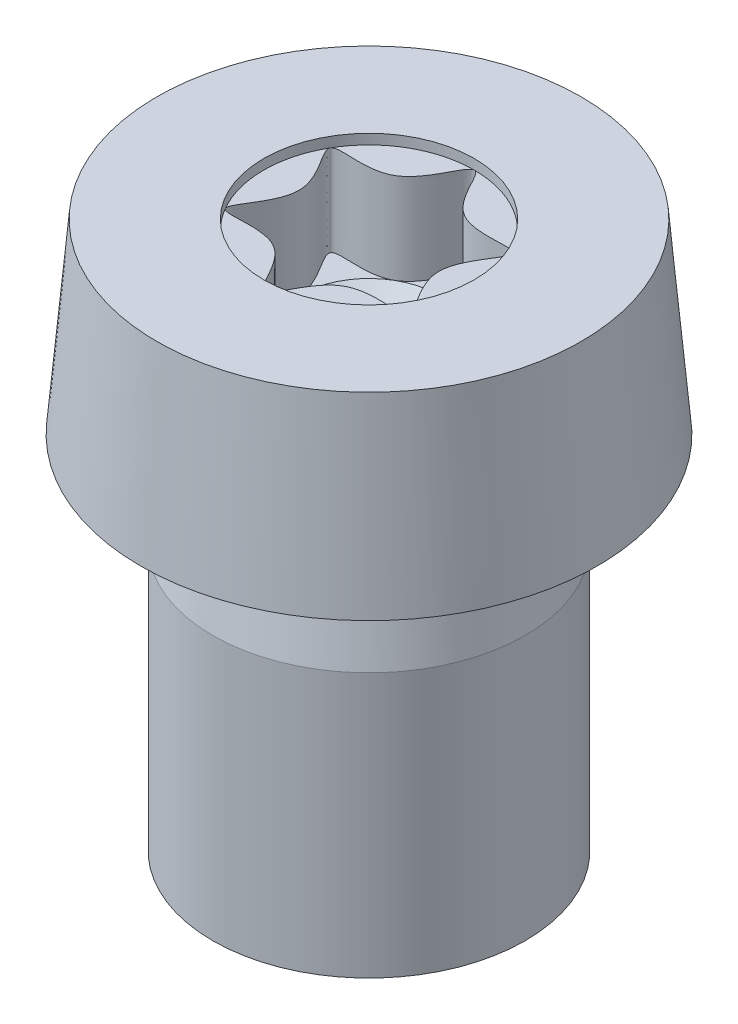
from build123d import *

# Parameters (mm, degrees)
FILLET1_R                 = 0.1
SOCKET_CUT_EXTRUDE1_DEPTH = 0.84
SKETCH3_R                 = 0.875
SOCKET_CUT_EXTRUDE2_DEPTH = 0.084


with BuildPart() as part:
    # Sketch1 → Body-Revolve (revolve)
    with BuildSketch(Plane.XY, mode=Mode.PRIVATE) as body_revolve_sk:
        Polygon((0, 4.55), (1.764392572, 4.55), (1.9, 3), (1.3, 3), (1.14, 3), (1.3, 2.2), (1.3, 0), (0, 0), align=None)
    revolve(body_revolve_sk.sketch.rotate(Axis((0, 0, 0), (0, 1, 0)), 90), axis=Axis((0, 0, 0), (0, 1, 0)))

    # Fillet1
    fillet1_edges = [part.edges().sort_by_distance(p)[0] for p in [
        (0, 3, 1.14),
    ]]
    fillet(fillet1_edges, radius=FILLET1_R)

    # Sketch2 → Socket-Cut-Extrude1 (cut)
    with BuildSketch(Plane(origin=(0, 4.55, 0), x_dir=(-1, 0, 0), z_dir=(0, 1, 0))):
        with BuildLine():
            add(Edge.make_bspline(
                [(0, -0.875), (-0.062906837, -0.875), (-0.18872051, -0.326873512), (-0.99511796, -0.574531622), (-0.37744102, 0), (-0.99511796, 0.574531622), (-0.18872051, 0.326873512), (0, 1.149063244), (0.18872051, 0.326873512), (0.99511796, 0.574531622), (0.37744102, 0), (0.99511796, -0.574531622), (0.18872051, -0.326873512), (0.062906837, -0.875), (0, -0.875)],
                knots=[0, 0, 0, 0, 0.083333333, 0.166666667, 0.25, 0.333333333, 0.416666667, 0.5, 0.583333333, 0.666666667, 0.75, 0.833333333, 0.916666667, 1, 1, 1, 1], degree=3))
        make_face()
    extrude(amount=-SOCKET_CUT_EXTRUDE1_DEPTH, mode=Mode.SUBTRACT)

    # Sketch3 → Socket-Cut-Extrude2 (cut)
    with BuildSketch(Plane(origin=(0, 4.55, 0), x_dir=(-1, 0, 0), z_dir=(0, 1, 0))):
        with Locations(Location((0, 0, 0), (0, 0, 90))):
            Circle(SKETCH3_R)
    extrude(amount=-SOCKET_CUT_EXTRUDE2_DEPTH, mode=Mode.SUBTRACT)

    # Sketch4 → Drill-Cut-Revolve (revolve, cut)
    with BuildSketch(Plane.XY, mode=Mode.PRIVATE) as drill_cut_revolve_sk:
        Polygon((0, 3.71), (0.583333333, 3.71), (0, 3.155), align=None)
    revolve(drill_cut_revolve_sk.sketch.rotate(Axis((0, 0, 0), (0, 1, 0)), 270), axis=Axis((0, 0, 0), (0, 1, 0)), mode=Mode.SUBTRACT)


solid = part.part
